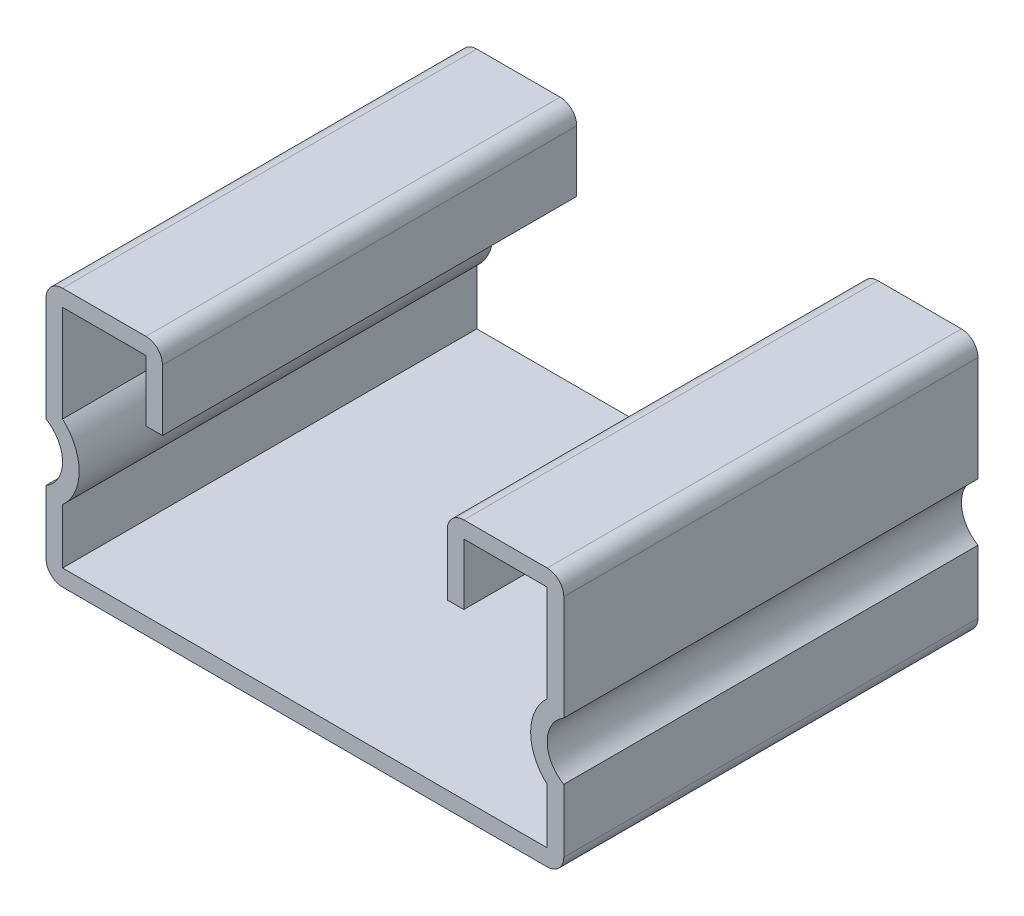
ISO-10303-21;
HEADER;
FILE_DESCRIPTION(('STEP AP214'),'2;1');
FILE_NAME('part.step','',(''),(''),'','','');
FILE_SCHEMA(('AUTOMOTIVE_DESIGN { 1 0 10303 214 1 1 1 1 }'));
ENDSEC;
DATA;
#1=APPLICATION_CONTEXT('core data for automotive mechanical design processes');
#2=APPLICATION_PROTOCOL_DEFINITION('international standard','automotive_design',2000,#1);
#3=PRODUCT_CONTEXT('',#1,'mechanical');
#4=PRODUCT('Part','Part','',(#3));
#5=PRODUCT_RELATED_PRODUCT_CATEGORY('part','',(#4));
#6=PRODUCT_DEFINITION_FORMATION('','',#4);
#7=PRODUCT_DEFINITION_CONTEXT('part definition',#1,'design');
#8=PRODUCT_DEFINITION('design','',#6,#7);
#9=PRODUCT_DEFINITION_SHAPE('','',#8);
#10=(LENGTH_UNIT() NAMED_UNIT(*) SI_UNIT(.MILLI.,.METRE.));
#11=(NAMED_UNIT(*) PLANE_ANGLE_UNIT() SI_UNIT($,.RADIAN.));
#12=(NAMED_UNIT(*) SI_UNIT($,.STERADIAN.) SOLID_ANGLE_UNIT());
#13=UNCERTAINTY_MEASURE_WITH_UNIT(LENGTH_MEASURE(1.E-05),#10,'distance_accuracy_value','');
#14=(GEOMETRIC_REPRESENTATION_CONTEXT(3) GLOBAL_UNCERTAINTY_ASSIGNED_CONTEXT((#13)) GLOBAL_UNIT_ASSIGNED_CONTEXT((#10,
#11,#12)) REPRESENTATION_CONTEXT('',''));
#15=CARTESIAN_POINT('',(0.,0.,0.));
#16=DIRECTION('',(0.,0.,1.));
#17=DIRECTION('',(1.,0.,0.));
#18=AXIS2_PLACEMENT_3D('',#15,#16,#17);
#19=CARTESIAN_POINT('',(-14.859,8.2042,12.7));
#20=DIRECTION('',(-1.,0.,0.));
#21=DIRECTION('',(0.,-1.,0.));
#22=AXIS2_PLACEMENT_3D('',#19,#20,#21);
#23=PLANE('',#22);
#24=DIRECTION('',(0.,1.,0.));
#25=VECTOR('',#24,1.);
#26=CARTESIAN_POINT('',(-14.859,8.2042,-12.7));
#27=LINE('',#26,#25);
#28=CARTESIAN_POINT('',(-14.859,2.27184506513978,-12.7));
#29=VERTEX_POINT('',#28);
#30=CARTESIAN_POINT('',(-14.859,8.2042,-12.7));
#31=VERTEX_POINT('',#30);
#32=EDGE_CURVE('E260',#29,#31,#27,.T.);
#33=ORIENTED_EDGE('',*,*,#32,.T.);
#34=DIRECTION('',(0.,0.,-1.));
#35=VECTOR('',#34,1.);
#36=CARTESIAN_POINT('',(-14.859,8.2042,12.7));
#37=LINE('',#36,#35);
#38=CARTESIAN_POINT('',(-14.859,8.2042,12.7));
#39=VERTEX_POINT('',#38);
#40=EDGE_CURVE('E11',#39,#31,#37,.T.);
#41=ORIENTED_EDGE('',*,*,#40,.F.);
#42=DIRECTION('',(0.,1.,0.));
#43=VECTOR('',#42,1.);
#44=CARTESIAN_POINT('',(-14.859,8.2042,12.7));
#45=LINE('',#44,#43);
#46=CARTESIAN_POINT('',(-14.859,2.27184506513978,12.7));
#47=VERTEX_POINT('',#46);
#48=EDGE_CURVE('E318',#47,#39,#45,.T.);
#49=ORIENTED_EDGE('',*,*,#48,.F.);
#50=DIRECTION('',(0.,0.,-1.));
#51=VECTOR('',#50,1.);
#52=CARTESIAN_POINT('',(-14.859,2.27184506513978,12.7));
#53=LINE('',#52,#51);
#54=EDGE_CURVE('E256',#47,#29,#53,.T.);
#55=ORIENTED_EDGE('',*,*,#54,.T.);
#56=EDGE_LOOP('',(#33,#41,#49,#55));
#57=FACE_BOUND('',#56,.T.);
#58=ADVANCED_FACE('F32',(#57),#23,.F.);
#59=CARTESIAN_POINT('',(-14.859,8.2042,12.7));
#60=DIRECTION('',(0.,1.,0.));
#61=DIRECTION('',(-1.,0.,0.));
#62=AXIS2_PLACEMENT_3D('',#59,#60,#61);
#63=PLANE('',#62);
#64=DIRECTION('',(1.,0.,0.));
#65=VECTOR('',#64,1.);
#66=CARTESIAN_POINT('',(-14.859,8.2042,-12.7));
#67=LINE('',#66,#65);
#68=CARTESIAN_POINT('',(-9.74725,8.20419999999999,-12.7));
#69=VERTEX_POINT('',#68);
#70=EDGE_CURVE('E263',#31,#69,#67,.T.);
#71=ORIENTED_EDGE('',*,*,#70,.T.);
#72=DIRECTION('',(0.,0.,-1.));
#73=VECTOR('',#72,1.);
#74=CARTESIAN_POINT('',(-9.74725,8.20419999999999,12.7));
#75=LINE('',#74,#73);
#76=CARTESIAN_POINT('',(-9.74725,8.20419999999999,12.7));
#77=VERTEX_POINT('',#76);
#78=EDGE_CURVE('E40',#77,#69,#75,.T.);
#79=ORIENTED_EDGE('',*,*,#78,.F.);
#80=DIRECTION('',(1.,0.,0.));
#81=VECTOR('',#80,1.);
#82=CARTESIAN_POINT('',(-14.859,8.2042,12.7));
#83=LINE('',#82,#81);
#84=EDGE_CURVE('E157',#39,#77,#83,.T.);
#85=ORIENTED_EDGE('',*,*,#84,.F.);
#86=ORIENTED_EDGE('',*,*,#40,.T.);
#87=EDGE_LOOP('',(#71,#79,#85,#86));
#88=FACE_BOUND('',#87,.T.);
#89=ADVANCED_FACE('F486',(#88),#63,.F.);
#90=CARTESIAN_POINT('',(-9.74725,8.20419999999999,12.7));
#91=DIRECTION('',(1.,0.,0.));
#92=DIRECTION('',(0.,0.,-1.));
#93=AXIS2_PLACEMENT_3D('',#90,#91,#92);
#94=PLANE('',#93);
#95=DIRECTION('',(0.,-1.,0.));
#96=VECTOR('',#95,1.);
#97=CARTESIAN_POINT('',(-9.74725,8.20419999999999,-12.7));
#98=LINE('',#97,#96);
#99=CARTESIAN_POINT('',(-9.74725,4.4577,-12.7));
#100=VERTEX_POINT('',#99);
#101=EDGE_CURVE('E265',#69,#100,#98,.T.);
#102=ORIENTED_EDGE('',*,*,#101,.T.);
#103=DIRECTION('',(0.,0.,-1.));
#104=VECTOR('',#103,1.);
#105=CARTESIAN_POINT('',(-9.74725,4.4577,12.7));
#106=LINE('',#105,#104);
#107=CARTESIAN_POINT('',(-9.74725,4.4577,12.7));
#108=VERTEX_POINT('',#107);
#109=EDGE_CURVE('E391',#108,#100,#106,.T.);
#110=ORIENTED_EDGE('',*,*,#109,.F.);
#111=DIRECTION('',(0.,-1.,0.));
#112=VECTOR('',#111,1.);
#113=CARTESIAN_POINT('',(-9.74725,8.20419999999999,12.7));
#114=LINE('',#113,#112);
#115=EDGE_CURVE('E399',#77,#108,#114,.T.);
#116=ORIENTED_EDGE('',*,*,#115,.F.);
#117=ORIENTED_EDGE('',*,*,#78,.T.);
#118=EDGE_LOOP('',(#102,#110,#116,#117));
#119=FACE_BOUND('',#118,.T.);
#120=ADVANCED_FACE('F397',(#119),#94,.F.);
#121=CARTESIAN_POINT('',(-9.74725,4.4577,12.7));
#122=DIRECTION('',(0.,1.,0.));
#123=DIRECTION('',(0.,0.,1.));
#124=AXIS2_PLACEMENT_3D('',#121,#122,#123);
#125=PLANE('',#124);
#126=DIRECTION('',(1.,0.,0.));
#127=VECTOR('',#126,1.);
#128=CARTESIAN_POINT('',(-9.74725,4.4577,-12.7));
#129=LINE('',#128,#127);
#130=CARTESIAN_POINT('',(-8.73125,4.4577,-12.7));
#131=VERTEX_POINT('',#130);
#132=EDGE_CURVE('E267',#100,#131,#129,.T.);
#133=ORIENTED_EDGE('',*,*,#132,.T.);
#134=DIRECTION('',(0.,0.,-1.));
#135=VECTOR('',#134,1.);
#136=CARTESIAN_POINT('',(-8.73125,4.4577,12.7));
#137=LINE('',#136,#135);
#138=CARTESIAN_POINT('',(-8.73125,4.4577,12.7));
#139=VERTEX_POINT('',#138);
#140=EDGE_CURVE('E388',#139,#131,#137,.T.);
#141=ORIENTED_EDGE('',*,*,#140,.F.);
#142=DIRECTION('',(1.,0.,0.));
#143=VECTOR('',#142,1.);
#144=CARTESIAN_POINT('',(-9.74725,4.4577,12.7));
#145=LINE('',#144,#143);
#146=EDGE_CURVE('E417',#108,#139,#145,.T.);
#147=ORIENTED_EDGE('',*,*,#146,.F.);
#148=ORIENTED_EDGE('',*,*,#109,.T.);
#149=EDGE_LOOP('',(#133,#141,#147,#148));
#150=FACE_BOUND('',#149,.T.);
#151=ADVANCED_FACE('F408',(#150),#125,.F.);
#152=CARTESIAN_POINT('',(-8.73125,8.20419999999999,12.7));
#153=DIRECTION('',(-1.,0.,0.));
#154=DIRECTION('',(0.,-1.,0.));
#155=AXIS2_PLACEMENT_3D('',#152,#153,#154);
#156=PLANE('',#155);
#157=DIRECTION('',(0.,1.,0.));
#158=VECTOR('',#157,1.);
#159=CARTESIAN_POINT('',(-8.73125,8.20419999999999,-12.7));
#160=LINE('',#159,#158);
#161=CARTESIAN_POINT('',(-8.73125,8.20419999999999,-12.7));
#162=VERTEX_POINT('',#161);
#163=EDGE_CURVE('E269',#131,#162,#160,.T.);
#164=ORIENTED_EDGE('',*,*,#163,.T.);
#165=DIRECTION('',(0.,0.,-1.));
#166=VECTOR('',#165,1.);
#167=CARTESIAN_POINT('',(-8.73125,8.20419999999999,12.7));
#168=LINE('',#167,#166);
#169=CARTESIAN_POINT('',(-8.73125,8.20419999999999,12.7));
#170=VERTEX_POINT('',#169);
#171=EDGE_CURVE('E385',#170,#162,#168,.T.);
#172=ORIENTED_EDGE('',*,*,#171,.F.);
#173=DIRECTION('',(0.,1.,0.));
#174=VECTOR('',#173,1.);
#175=CARTESIAN_POINT('',(-8.73125,8.20419999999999,12.7));
#176=LINE('',#175,#174);
#177=EDGE_CURVE('E414',#139,#170,#176,.T.);
#178=ORIENTED_EDGE('',*,*,#177,.F.);
#179=ORIENTED_EDGE('',*,*,#140,.T.);
#180=EDGE_LOOP('',(#164,#172,#178,#179));
#181=FACE_BOUND('',#180,.T.);
#182=ADVANCED_FACE('F412',(#181),#156,.F.);
#183=CARTESIAN_POINT('',(-9.74725,8.20419999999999,12.7));
#184=DIRECTION('',(0.,0.,-1.));
#185=DIRECTION('',(-1.,0.,0.));
#186=AXIS2_PLACEMENT_3D('',#183,#184,#185);
#187=CYLINDRICAL_SURFACE('',#186,1.016);
#188=CARTESIAN_POINT('',(-9.74725,8.20419999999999,-12.7));
#189=DIRECTION('',(0.,0.,1.));
#190=DIRECTION('',(-1.,0.,0.));
#191=AXIS2_PLACEMENT_3D('',#188,#189,#190);
#192=CIRCLE('',#191,1.016);
#193=CARTESIAN_POINT('',(-9.74725,9.22019999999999,-12.7));
#194=VERTEX_POINT('',#193);
#195=EDGE_CURVE('E271',#162,#194,#192,.T.);
#196=ORIENTED_EDGE('',*,*,#195,.T.);
#197=DIRECTION('',(0.,0.,-1.));
#198=VECTOR('',#197,1.);
#199=CARTESIAN_POINT('',(-9.74725,9.22019999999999,12.7));
#200=LINE('',#199,#198);
#201=CARTESIAN_POINT('',(-9.74725,9.22019999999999,12.7));
#202=VERTEX_POINT('',#201);
#203=EDGE_CURVE('E382',#202,#194,#200,.T.);
#204=ORIENTED_EDGE('',*,*,#203,.F.);
#205=CARTESIAN_POINT('',(-9.74725,8.20419999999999,12.7));
#206=DIRECTION('',(0.,0.,1.));
#207=DIRECTION('',(-1.,0.,0.));
#208=AXIS2_PLACEMENT_3D('',#205,#206,#207);
#209=CIRCLE('',#208,1.016);
#210=EDGE_CURVE('E416',#170,#202,#209,.T.);
#211=ORIENTED_EDGE('',*,*,#210,.F.);
#212=ORIENTED_EDGE('',*,*,#171,.T.);
#213=EDGE_LOOP('',(#196,#204,#211,#212));
#214=FACE_BOUND('',#213,.T.);
#215=ADVANCED_FACE('F499',(#214),#187,.T.);
#216=CARTESIAN_POINT('',(-14.859,9.2202,12.7));
#217=DIRECTION('',(0.,-1.,0.));
#218=DIRECTION('',(1.,0.,0.));
#219=AXIS2_PLACEMENT_3D('',#216,#217,#218);
#220=PLANE('',#219);
#221=DIRECTION('',(-1.,0.,0.));
#222=VECTOR('',#221,1.);
#223=CARTESIAN_POINT('',(-14.859,9.2202,-12.7));
#224=LINE('',#223,#222);
#225=CARTESIAN_POINT('',(-14.859,9.2202,-12.7));
#226=VERTEX_POINT('',#225);
#227=EDGE_CURVE('E273',#194,#226,#224,.T.);
#228=ORIENTED_EDGE('',*,*,#227,.T.);
#229=DIRECTION('',(0.,0.,-1.));
#230=VECTOR('',#229,1.);
#231=CARTESIAN_POINT('',(-14.859,9.2202,12.7));
#232=LINE('',#231,#230);
#233=CARTESIAN_POINT('',(-14.859,9.2202,12.7));
#234=VERTEX_POINT('',#233);
#235=EDGE_CURVE('E379',#234,#226,#232,.T.);
#236=ORIENTED_EDGE('',*,*,#235,.F.);
#237=DIRECTION('',(-1.,0.,0.));
#238=VECTOR('',#237,1.);
#239=CARTESIAN_POINT('',(-14.859,9.2202,12.7));
#240=LINE('',#239,#238);
#241=EDGE_CURVE('E419',#202,#234,#240,.T.);
#242=ORIENTED_EDGE('',*,*,#241,.F.);
#243=ORIENTED_EDGE('',*,*,#203,.T.);
#244=EDGE_LOOP('',(#228,#236,#242,#243));
#245=FACE_BOUND('',#244,.T.);
#246=ADVANCED_FACE('F502',(#245),#220,.F.);
#247=CARTESIAN_POINT('',(-14.859,8.2042,12.7));
#248=DIRECTION('',(0.,0.,-1.));
#249=DIRECTION('',(-1.,0.,0.));
#250=AXIS2_PLACEMENT_3D('',#247,#248,#249);
#251=CYLINDRICAL_SURFACE('',#250,1.016);
#252=CARTESIAN_POINT('',(-14.859,8.2042,-12.7));
#253=DIRECTION('',(0.,0.,1.));
#254=DIRECTION('',(-1.,0.,0.));
#255=AXIS2_PLACEMENT_3D('',#252,#253,#254);
#256=CIRCLE('',#255,1.016);
#257=CARTESIAN_POINT('',(-15.875,8.2042,-12.7));
#258=VERTEX_POINT('',#257);
#259=EDGE_CURVE('E275',#226,#258,#256,.T.);
#260=ORIENTED_EDGE('',*,*,#259,.T.);
#261=DIRECTION('',(0.,0.,-1.));
#262=VECTOR('',#261,1.);
#263=CARTESIAN_POINT('',(-15.875,8.2042,12.7));
#264=LINE('',#263,#262);
#265=CARTESIAN_POINT('',(-15.875,8.2042,12.7));
#266=VERTEX_POINT('',#265);
#267=EDGE_CURVE('E376',#266,#258,#264,.T.);
#268=ORIENTED_EDGE('',*,*,#267,.F.);
#269=CARTESIAN_POINT('',(-14.859,8.2042,12.7));
#270=DIRECTION('',(0.,0.,1.));
#271=DIRECTION('',(-1.,0.,0.));
#272=AXIS2_PLACEMENT_3D('',#269,#270,#271);
#273=CIRCLE('',#272,1.016);
#274=EDGE_CURVE('E425',#234,#266,#273,.T.);
#275=ORIENTED_EDGE('',*,*,#274,.F.);
#276=ORIENTED_EDGE('',*,*,#235,.T.);
#277=EDGE_LOOP('',(#260,#268,#275,#276));
#278=FACE_BOUND('',#277,.T.);
#279=ADVANCED_FACE('F506',(#278),#251,.T.);
#280=CARTESIAN_POINT('',(-15.875,8.2042,12.7));
#281=DIRECTION('',(1.,0.,0.));
#282=DIRECTION('',(0.,0.,-1.));
#283=AXIS2_PLACEMENT_3D('',#280,#281,#282);
#284=PLANE('',#283);
#285=DIRECTION('',(0.,-1.,0.));
#286=VECTOR('',#285,1.);
#287=CARTESIAN_POINT('',(-15.875,8.2042,-12.7));
#288=LINE('',#287,#286);
#289=CARTESIAN_POINT('',(-15.875,1.75976362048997,-12.7));
#290=VERTEX_POINT('',#289);
#291=EDGE_CURVE('E277',#258,#290,#288,.T.);
#292=ORIENTED_EDGE('',*,*,#291,.T.);
#293=DIRECTION('',(0.,0.,-1.));
#294=VECTOR('',#293,1.);
#295=CARTESIAN_POINT('',(-15.875,1.75976362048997,12.7));
#296=LINE('',#295,#294);
#297=CARTESIAN_POINT('',(-15.875,1.75976362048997,12.7));
#298=VERTEX_POINT('',#297);
#299=EDGE_CURVE('E373',#298,#290,#296,.T.);
#300=ORIENTED_EDGE('',*,*,#299,.F.);
#301=DIRECTION('',(0.,-1.,0.));
#302=VECTOR('',#301,1.);
#303=CARTESIAN_POINT('',(-15.875,8.2042,12.7));
#304=LINE('',#303,#302);
#305=EDGE_CURVE('E427',#266,#298,#304,.T.);
#306=ORIENTED_EDGE('',*,*,#305,.F.);
#307=ORIENTED_EDGE('',*,*,#267,.T.);
#308=EDGE_LOOP('',(#292,#300,#306,#307));
#309=FACE_BOUND('',#308,.T.);
#310=ADVANCED_FACE('F510',(#309),#284,.F.);
#311=CARTESIAN_POINT('',(-16.891,0.,12.7));
#312=DIRECTION('',(0.,0.,-1.));
#313=DIRECTION('',(-1.,0.,0.));
#314=AXIS2_PLACEMENT_3D('',#311,#312,#313);
#315=CYLINDRICAL_SURFACE('',#314,2.032);
#316=CARTESIAN_POINT('',(-16.891,0.,-12.7));
#317=DIRECTION('',(0.,0.,-1.));
#318=DIRECTION('',(1.,0.,0.));
#319=AXIS2_PLACEMENT_3D('',#316,#317,#318);
#320=CIRCLE('',#319,2.032);
#321=CARTESIAN_POINT('',(-15.875,-1.75976362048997,-12.7));
#322=VERTEX_POINT('',#321);
#323=EDGE_CURVE('E279',#290,#322,#320,.T.);
#324=ORIENTED_EDGE('',*,*,#323,.T.);
#325=DIRECTION('',(0.,0.,-1.));
#326=VECTOR('',#325,1.);
#327=CARTESIAN_POINT('',(-15.875,-1.75976362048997,12.7));
#328=LINE('',#327,#326);
#329=CARTESIAN_POINT('',(-15.875,-1.75976362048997,12.7));
#330=VERTEX_POINT('',#329);
#331=EDGE_CURVE('E370',#330,#322,#328,.T.);
#332=ORIENTED_EDGE('',*,*,#331,.F.);
#333=CARTESIAN_POINT('',(-16.891,0.,12.7));
#334=DIRECTION('',(0.,0.,-1.));
#335=DIRECTION('',(1.,0.,0.));
#336=AXIS2_PLACEMENT_3D('',#333,#334,#335);
#337=CIRCLE('',#336,2.032);
#338=EDGE_CURVE('E429',#298,#330,#337,.T.);
#339=ORIENTED_EDGE('',*,*,#338,.F.);
#340=ORIENTED_EDGE('',*,*,#299,.T.);
#341=EDGE_LOOP('',(#324,#332,#339,#340));
#342=FACE_BOUND('',#341,.T.);
#343=ADVANCED_FACE('F514',(#342),#315,.F.);
#344=CARTESIAN_POINT('',(-15.875,-1.75976362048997,12.7));
#345=DIRECTION('',(1.,0.,0.));
#346=DIRECTION('',(0.,1.,0.));
#347=AXIS2_PLACEMENT_3D('',#344,#345,#346);
#348=PLANE('',#347);
#349=DIRECTION('',(0.,-1.,0.));
#350=VECTOR('',#349,1.);
#351=CARTESIAN_POINT('',(-15.875,-1.75976362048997,-12.7));
#352=LINE('',#351,#350);
#353=CARTESIAN_POINT('',(-15.875,-5.6388,-12.7));
#354=VERTEX_POINT('',#353);
#355=EDGE_CURVE('E281',#322,#354,#352,.T.);
#356=ORIENTED_EDGE('',*,*,#355,.T.);
#357=DIRECTION('',(0.,0.,-1.));
#358=VECTOR('',#357,1.);
#359=CARTESIAN_POINT('',(-15.875,-5.6388,12.7));
#360=LINE('',#359,#358);
#361=CARTESIAN_POINT('',(-15.875,-5.6388,12.7));
#362=VERTEX_POINT('',#361);
#363=EDGE_CURVE('E367',#362,#354,#360,.T.);
#364=ORIENTED_EDGE('',*,*,#363,.F.);
#365=DIRECTION('',(0.,-1.,0.));
#366=VECTOR('',#365,1.);
#367=CARTESIAN_POINT('',(-15.875,-1.75976362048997,12.7));
#368=LINE('',#367,#366);
#369=EDGE_CURVE('E431',#330,#362,#368,.T.);
#370=ORIENTED_EDGE('',*,*,#369,.F.);
#371=ORIENTED_EDGE('',*,*,#331,.T.);
#372=EDGE_LOOP('',(#356,#364,#370,#371));
#373=FACE_BOUND('',#372,.T.);
#374=ADVANCED_FACE('F518',(#373),#348,.F.);
#375=CARTESIAN_POINT('',(-14.859,-5.6388,12.7));
#376=DIRECTION('',(0.,0.,-1.));
#377=DIRECTION('',(-1.,0.,0.));
#378=AXIS2_PLACEMENT_3D('',#375,#376,#377);
#379=CYLINDRICAL_SURFACE('',#378,1.016);
#380=CARTESIAN_POINT('',(-14.859,-5.6388,-12.7));
#381=DIRECTION('',(0.,0.,1.));
#382=DIRECTION('',(-1.,0.,0.));
#383=AXIS2_PLACEMENT_3D('',#380,#381,#382);
#384=CIRCLE('',#383,1.016);
#385=CARTESIAN_POINT('',(-14.859,-6.6548,-12.7));
#386=VERTEX_POINT('',#385);
#387=EDGE_CURVE('E283',#354,#386,#384,.T.);
#388=ORIENTED_EDGE('',*,*,#387,.T.);
#389=DIRECTION('',(0.,0.,-1.));
#390=VECTOR('',#389,1.);
#391=CARTESIAN_POINT('',(-14.859,-6.6548,12.7));
#392=LINE('',#391,#390);
#393=CARTESIAN_POINT('',(-14.859,-6.6548,12.7));
#394=VERTEX_POINT('',#393);
#395=EDGE_CURVE('E364',#394,#386,#392,.T.);
#396=ORIENTED_EDGE('',*,*,#395,.F.);
#397=CARTESIAN_POINT('',(-14.859,-5.6388,12.7));
#398=DIRECTION('',(0.,0.,1.));
#399=DIRECTION('',(-1.,0.,0.));
#400=AXIS2_PLACEMENT_3D('',#397,#398,#399);
#401=CIRCLE('',#400,1.016);
#402=EDGE_CURVE('E433',#362,#394,#401,.T.);
#403=ORIENTED_EDGE('',*,*,#402,.F.);
#404=ORIENTED_EDGE('',*,*,#363,.T.);
#405=EDGE_LOOP('',(#388,#396,#403,#404));
#406=FACE_BOUND('',#405,.T.);
#407=ADVANCED_FACE('F522',(#406),#379,.T.);
#408=CARTESIAN_POINT('',(-14.859,-6.6548,12.7));
#409=DIRECTION('',(0.,1.,0.));
#410=DIRECTION('',(0.,0.,1.));
#411=AXIS2_PLACEMENT_3D('',#408,#409,#410);
#412=PLANE('',#411);
#413=DIRECTION('',(1.,0.,0.));
#414=VECTOR('',#413,1.);
#415=CARTESIAN_POINT('',(-14.859,-6.6548,-12.7));
#416=LINE('',#415,#414);
#417=CARTESIAN_POINT('',(14.859,-6.6548,-12.7));
#418=VERTEX_POINT('',#417);
#419=EDGE_CURVE('E285',#386,#418,#416,.T.);
#420=ORIENTED_EDGE('',*,*,#419,.T.);
#421=DIRECTION('',(0.,0.,-1.));
#422=VECTOR('',#421,1.);
#423=CARTESIAN_POINT('',(14.859,-6.6548,12.7));
#424=LINE('',#423,#422);
#425=CARTESIAN_POINT('',(14.859,-6.6548,12.7));
#426=VERTEX_POINT('',#425);
#427=EDGE_CURVE('E361',#426,#418,#424,.T.);
#428=ORIENTED_EDGE('',*,*,#427,.F.);
#429=DIRECTION('',(1.,0.,0.));
#430=VECTOR('',#429,1.);
#431=CARTESIAN_POINT('',(-14.859,-6.6548,12.7));
#432=LINE('',#431,#430);
#433=EDGE_CURVE('E435',#394,#426,#432,.T.);
#434=ORIENTED_EDGE('',*,*,#433,.F.);
#435=ORIENTED_EDGE('',*,*,#395,.T.);
#436=EDGE_LOOP('',(#420,#428,#434,#435));
#437=FACE_BOUND('',#436,.T.);
#438=ADVANCED_FACE('F526',(#437),#412,.F.);
#439=CARTESIAN_POINT('',(14.859,-5.6388,12.7));
#440=DIRECTION('',(0.,0.,-1.));
#441=DIRECTION('',(-1.,0.,0.));
#442=AXIS2_PLACEMENT_3D('',#439,#440,#441);
#443=CYLINDRICAL_SURFACE('',#442,1.016);
#444=CARTESIAN_POINT('',(14.859,-5.6388,-12.7));
#445=DIRECTION('',(0.,0.,1.));
#446=DIRECTION('',(-1.,0.,0.));
#447=AXIS2_PLACEMENT_3D('',#444,#445,#446);
#448=CIRCLE('',#447,1.016);
#449=CARTESIAN_POINT('',(15.875,-5.6388,-12.7));
#450=VERTEX_POINT('',#449);
#451=EDGE_CURVE('E287',#418,#450,#448,.T.);
#452=ORIENTED_EDGE('',*,*,#451,.T.);
#453=DIRECTION('',(0.,0.,-1.));
#454=VECTOR('',#453,1.);
#455=CARTESIAN_POINT('',(15.875,-5.6388,12.7));
#456=LINE('',#455,#454);
#457=CARTESIAN_POINT('',(15.875,-5.6388,12.7));
#458=VERTEX_POINT('',#457);
#459=EDGE_CURVE('E358',#458,#450,#456,.T.);
#460=ORIENTED_EDGE('',*,*,#459,.F.);
#461=CARTESIAN_POINT('',(14.859,-5.6388,12.7));
#462=DIRECTION('',(0.,0.,1.));
#463=DIRECTION('',(-1.,0.,0.));
#464=AXIS2_PLACEMENT_3D('',#461,#462,#463);
#465=CIRCLE('',#464,1.016);
#466=EDGE_CURVE('E437',#426,#458,#465,.T.);
#467=ORIENTED_EDGE('',*,*,#466,.F.);
#468=ORIENTED_EDGE('',*,*,#427,.T.);
#469=EDGE_LOOP('',(#452,#460,#467,#468));
#470=FACE_BOUND('',#469,.T.);
#471=ADVANCED_FACE('F530',(#470),#443,.T.);
#472=CARTESIAN_POINT('',(15.875,-5.6388,12.7));
#473=DIRECTION('',(-1.,0.,0.));
#474=DIRECTION('',(0.,0.,1.));
#475=AXIS2_PLACEMENT_3D('',#472,#473,#474);
#476=PLANE('',#475);
#477=DIRECTION('',(0.,1.,0.));
#478=VECTOR('',#477,1.);
#479=CARTESIAN_POINT('',(15.875,-5.6388,-12.7));
#480=LINE('',#479,#478);
#481=CARTESIAN_POINT('',(15.875,-1.75976362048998,-12.7));
#482=VERTEX_POINT('',#481);
#483=EDGE_CURVE('E289',#450,#482,#480,.T.);
#484=ORIENTED_EDGE('',*,*,#483,.T.);
#485=DIRECTION('',(0.,0.,-1.));
#486=VECTOR('',#485,1.);
#487=CARTESIAN_POINT('',(15.875,-1.75976362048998,12.7));
#488=LINE('',#487,#486);
#489=CARTESIAN_POINT('',(15.875,-1.75976362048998,12.7));
#490=VERTEX_POINT('',#489);
#491=EDGE_CURVE('E355',#490,#482,#488,.T.);
#492=ORIENTED_EDGE('',*,*,#491,.F.);
#493=DIRECTION('',(0.,1.,0.));
#494=VECTOR('',#493,1.);
#495=CARTESIAN_POINT('',(15.875,-5.6388,12.7));
#496=LINE('',#495,#494);
#497=EDGE_CURVE('E439',#458,#490,#496,.T.);
#498=ORIENTED_EDGE('',*,*,#497,.F.);
#499=ORIENTED_EDGE('',*,*,#459,.T.);
#500=EDGE_LOOP('',(#484,#492,#498,#499));
#501=FACE_BOUND('',#500,.T.);
#502=ADVANCED_FACE('F534',(#501),#476,.F.);
#503=CARTESIAN_POINT('',(16.891,0.,12.7));
#504=DIRECTION('',(0.,0.,-1.));
#505=DIRECTION('',(-1.,0.,0.));
#506=AXIS2_PLACEMENT_3D('',#503,#504,#505);
#507=CYLINDRICAL_SURFACE('',#506,2.032);
#508=CARTESIAN_POINT('',(16.891,0.,-12.7));
#509=DIRECTION('',(0.,0.,-1.));
#510=DIRECTION('',(1.,0.,0.));
#511=AXIS2_PLACEMENT_3D('',#508,#509,#510);
#512=CIRCLE('',#511,2.032);
#513=CARTESIAN_POINT('',(15.875,1.75976362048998,-12.7));
#514=VERTEX_POINT('',#513);
#515=EDGE_CURVE('E291',#482,#514,#512,.T.);
#516=ORIENTED_EDGE('',*,*,#515,.T.);
#517=DIRECTION('',(0.,0.,-1.));
#518=VECTOR('',#517,1.);
#519=CARTESIAN_POINT('',(15.875,1.75976362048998,12.7));
#520=LINE('',#519,#518);
#521=CARTESIAN_POINT('',(15.875,1.75976362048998,12.7));
#522=VERTEX_POINT('',#521);
#523=EDGE_CURVE('E352',#522,#514,#520,.T.);
#524=ORIENTED_EDGE('',*,*,#523,.F.);
#525=CARTESIAN_POINT('',(16.891,0.,12.7));
#526=DIRECTION('',(0.,0.,-1.));
#527=DIRECTION('',(1.,0.,0.));
#528=AXIS2_PLACEMENT_3D('',#525,#526,#527);
#529=CIRCLE('',#528,2.032);
#530=EDGE_CURVE('E441',#490,#522,#529,.T.);
#531=ORIENTED_EDGE('',*,*,#530,.F.);
#532=ORIENTED_EDGE('',*,*,#491,.T.);
#533=EDGE_LOOP('',(#516,#524,#531,#532));
#534=FACE_BOUND('',#533,.T.);
#535=ADVANCED_FACE('F538',(#534),#507,.F.);
#536=CARTESIAN_POINT('',(15.875,1.75976362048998,12.7));
#537=DIRECTION('',(-1.,0.,0.));
#538=DIRECTION('',(0.,-1.,0.));
#539=AXIS2_PLACEMENT_3D('',#536,#537,#538);
#540=PLANE('',#539);
#541=DIRECTION('',(0.,1.,0.));
#542=VECTOR('',#541,1.);
#543=CARTESIAN_POINT('',(15.875,1.75976362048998,-12.7));
#544=LINE('',#543,#542);
#545=CARTESIAN_POINT('',(15.875,8.2042,-12.7));
#546=VERTEX_POINT('',#545);
#547=EDGE_CURVE('E293',#514,#546,#544,.T.);
#548=ORIENTED_EDGE('',*,*,#547,.T.);
#549=DIRECTION('',(0.,0.,-1.));
#550=VECTOR('',#549,1.);
#551=CARTESIAN_POINT('',(15.875,8.2042,12.7));
#552=LINE('',#551,#550);
#553=CARTESIAN_POINT('',(15.875,8.2042,12.7));
#554=VERTEX_POINT('',#553);
#555=EDGE_CURVE('E349',#554,#546,#552,.T.);
#556=ORIENTED_EDGE('',*,*,#555,.F.);
#557=DIRECTION('',(0.,1.,0.));
#558=VECTOR('',#557,1.);
#559=CARTESIAN_POINT('',(15.875,1.75976362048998,12.7));
#560=LINE('',#559,#558);
#561=EDGE_CURVE('E443',#522,#554,#560,.T.);
#562=ORIENTED_EDGE('',*,*,#561,.F.);
#563=ORIENTED_EDGE('',*,*,#523,.T.);
#564=EDGE_LOOP('',(#548,#556,#562,#563));
#565=FACE_BOUND('',#564,.T.);
#566=ADVANCED_FACE('F542',(#565),#540,.F.);
#567=CARTESIAN_POINT('',(14.859,8.2042,12.7));
#568=DIRECTION('',(0.,0.,-1.));
#569=DIRECTION('',(-1.,0.,0.));
#570=AXIS2_PLACEMENT_3D('',#567,#568,#569);
#571=CYLINDRICAL_SURFACE('',#570,1.016);
#572=CARTESIAN_POINT('',(14.859,8.2042,-12.7));
#573=DIRECTION('',(0.,0.,1.));
#574=DIRECTION('',(-1.,0.,0.));
#575=AXIS2_PLACEMENT_3D('',#572,#573,#574);
#576=CIRCLE('',#575,1.016);
#577=CARTESIAN_POINT('',(14.859,9.2202,-12.7));
#578=VERTEX_POINT('',#577);
#579=EDGE_CURVE('E295',#546,#578,#576,.T.);
#580=ORIENTED_EDGE('',*,*,#579,.T.);
#581=DIRECTION('',(0.,0.,-1.));
#582=VECTOR('',#581,1.);
#583=CARTESIAN_POINT('',(14.859,9.2202,12.7));
#584=LINE('',#583,#582);
#585=CARTESIAN_POINT('',(14.859,9.2202,12.7));
#586=VERTEX_POINT('',#585);
#587=EDGE_CURVE('E346',#586,#578,#584,.T.);
#588=ORIENTED_EDGE('',*,*,#587,.F.);
#589=CARTESIAN_POINT('',(14.859,8.2042,12.7));
#590=DIRECTION('',(0.,0.,1.));
#591=DIRECTION('',(-1.,0.,0.));
#592=AXIS2_PLACEMENT_3D('',#589,#590,#591);
#593=CIRCLE('',#592,1.016);
#594=EDGE_CURVE('E445',#554,#586,#593,.T.);
#595=ORIENTED_EDGE('',*,*,#594,.F.);
#596=ORIENTED_EDGE('',*,*,#555,.T.);
#597=EDGE_LOOP('',(#580,#588,#595,#596));
#598=FACE_BOUND('',#597,.T.);
#599=ADVANCED_FACE('F546',(#598),#571,.T.);
#600=CARTESIAN_POINT('',(14.859,9.2202,12.7));
#601=DIRECTION('',(0.,-1.,0.));
#602=DIRECTION('',(1.,0.,0.));
#603=AXIS2_PLACEMENT_3D('',#600,#601,#602);
#604=PLANE('',#603);
#605=DIRECTION('',(-1.,0.,0.));
#606=VECTOR('',#605,1.);
#607=CARTESIAN_POINT('',(14.859,9.2202,-12.7));
#608=LINE('',#607,#606);
#609=CARTESIAN_POINT('',(9.74725,9.2202,-12.7));
#610=VERTEX_POINT('',#609);
#611=EDGE_CURVE('E297',#578,#610,#608,.T.);
#612=ORIENTED_EDGE('',*,*,#611,.T.);
#613=DIRECTION('',(0.,0.,-1.));
#614=VECTOR('',#613,1.);
#615=CARTESIAN_POINT('',(9.74725,9.2202,12.7));
#616=LINE('',#615,#614);
#617=CARTESIAN_POINT('',(9.74725,9.2202,12.7));
#618=VERTEX_POINT('',#617);
#619=EDGE_CURVE('E343',#618,#610,#616,.T.);
#620=ORIENTED_EDGE('',*,*,#619,.F.);
#621=DIRECTION('',(-1.,0.,0.));
#622=VECTOR('',#621,1.);
#623=CARTESIAN_POINT('',(14.859,9.2202,12.7));
#624=LINE('',#623,#622);
#625=EDGE_CURVE('E447',#586,#618,#624,.T.);
#626=ORIENTED_EDGE('',*,*,#625,.F.);
#627=ORIENTED_EDGE('',*,*,#587,.T.);
#628=EDGE_LOOP('',(#612,#620,#626,#627));
#629=FACE_BOUND('',#628,.T.);
#630=ADVANCED_FACE('F550',(#629),#604,.F.);
#631=CARTESIAN_POINT('',(9.74725,8.2042,12.7));
#632=DIRECTION('',(0.,0.,-1.));
#633=DIRECTION('',(-1.,0.,0.));
#634=AXIS2_PLACEMENT_3D('',#631,#632,#633);
#635=CYLINDRICAL_SURFACE('',#634,1.016);
#636=CARTESIAN_POINT('',(9.74725,8.2042,-12.7));
#637=DIRECTION('',(0.,0.,1.));
#638=DIRECTION('',(-1.,0.,0.));
#639=AXIS2_PLACEMENT_3D('',#636,#637,#638);
#640=CIRCLE('',#639,1.016);
#641=CARTESIAN_POINT('',(8.73125,8.2042,-12.7));
#642=VERTEX_POINT('',#641);
#643=EDGE_CURVE('E299',#610,#642,#640,.T.);
#644=ORIENTED_EDGE('',*,*,#643,.T.);
#645=DIRECTION('',(0.,0.,-1.));
#646=VECTOR('',#645,1.);
#647=CARTESIAN_POINT('',(8.73125,8.2042,12.7));
#648=LINE('',#647,#646);
#649=CARTESIAN_POINT('',(8.73125,8.2042,12.7));
#650=VERTEX_POINT('',#649);
#651=EDGE_CURVE('E340',#650,#642,#648,.T.);
#652=ORIENTED_EDGE('',*,*,#651,.F.);
#653=CARTESIAN_POINT('',(9.74725,8.2042,12.7));
#654=DIRECTION('',(0.,0.,1.));
#655=DIRECTION('',(-1.,0.,0.));
#656=AXIS2_PLACEMENT_3D('',#653,#654,#655);
#657=CIRCLE('',#656,1.016);
#658=EDGE_CURVE('E449',#618,#650,#657,.T.);
#659=ORIENTED_EDGE('',*,*,#658,.F.);
#660=ORIENTED_EDGE('',*,*,#619,.T.);
#661=EDGE_LOOP('',(#644,#652,#659,#660));
#662=FACE_BOUND('',#661,.T.);
#663=ADVANCED_FACE('F554',(#662),#635,.T.);
#664=CARTESIAN_POINT('',(8.73125,8.2042,12.7));
#665=DIRECTION('',(1.,0.,0.));
#666=DIRECTION('',(0.,0.,-1.));
#667=AXIS2_PLACEMENT_3D('',#664,#665,#666);
#668=PLANE('',#667);
#669=DIRECTION('',(0.,-1.,0.));
#670=VECTOR('',#669,1.);
#671=CARTESIAN_POINT('',(8.73125,8.2042,-12.7));
#672=LINE('',#671,#670);
#673=CARTESIAN_POINT('',(8.73125,4.4577,-12.7));
#674=VERTEX_POINT('',#673);
#675=EDGE_CURVE('E301',#642,#674,#672,.T.);
#676=ORIENTED_EDGE('',*,*,#675,.T.);
#677=DIRECTION('',(0.,0.,-1.));
#678=VECTOR('',#677,1.);
#679=CARTESIAN_POINT('',(8.73125,4.4577,12.7));
#680=LINE('',#679,#678);
#681=CARTESIAN_POINT('',(8.73125,4.4577,12.7));
#682=VERTEX_POINT('',#681);
#683=EDGE_CURVE('E337',#682,#674,#680,.T.);
#684=ORIENTED_EDGE('',*,*,#683,.F.);
#685=DIRECTION('',(0.,-1.,0.));
#686=VECTOR('',#685,1.);
#687=CARTESIAN_POINT('',(8.73125,8.2042,12.7));
#688=LINE('',#687,#686);
#689=EDGE_CURVE('E451',#650,#682,#688,.T.);
#690=ORIENTED_EDGE('',*,*,#689,.F.);
#691=ORIENTED_EDGE('',*,*,#651,.T.);
#692=EDGE_LOOP('',(#676,#684,#690,#691));
#693=FACE_BOUND('',#692,.T.);
#694=ADVANCED_FACE('F558',(#693),#668,.F.);
#695=CARTESIAN_POINT('',(8.73125,4.4577,12.7));
#696=DIRECTION('',(0.,1.,0.));
#697=DIRECTION('',(0.,0.,1.));
#698=AXIS2_PLACEMENT_3D('',#695,#696,#697);
#699=PLANE('',#698);
#700=DIRECTION('',(1.,0.,0.));
#701=VECTOR('',#700,1.);
#702=CARTESIAN_POINT('',(8.73125,4.4577,-12.7));
#703=LINE('',#702,#701);
#704=CARTESIAN_POINT('',(9.74725,4.4577,-12.7));
#705=VERTEX_POINT('',#704);
#706=EDGE_CURVE('E303',#674,#705,#703,.T.);
#707=ORIENTED_EDGE('',*,*,#706,.T.);
#708=DIRECTION('',(0.,0.,-1.));
#709=VECTOR('',#708,1.);
#710=CARTESIAN_POINT('',(9.74725,4.4577,12.7));
#711=LINE('',#710,#709);
#712=CARTESIAN_POINT('',(9.74725,4.4577,12.7));
#713=VERTEX_POINT('',#712);
#714=EDGE_CURVE('E334',#713,#705,#711,.T.);
#715=ORIENTED_EDGE('',*,*,#714,.F.);
#716=DIRECTION('',(1.,0.,0.));
#717=VECTOR('',#716,1.);
#718=CARTESIAN_POINT('',(8.73125,4.4577,12.7));
#719=LINE('',#718,#717);
#720=EDGE_CURVE('E453',#682,#713,#719,.T.);
#721=ORIENTED_EDGE('',*,*,#720,.F.);
#722=ORIENTED_EDGE('',*,*,#683,.T.);
#723=EDGE_LOOP('',(#707,#715,#721,#722));
#724=FACE_BOUND('',#723,.T.);
#725=ADVANCED_FACE('F562',(#724),#699,.F.);
#726=CARTESIAN_POINT('',(9.74725,8.2042,12.7));
#727=DIRECTION('',(-1.,0.,0.));
#728=DIRECTION('',(0.,0.,1.));
#729=AXIS2_PLACEMENT_3D('',#726,#727,#728);
#730=PLANE('',#729);
#731=DIRECTION('',(0.,1.,0.));
#732=VECTOR('',#731,1.);
#733=CARTESIAN_POINT('',(9.74725,8.2042,-12.7));
#734=LINE('',#733,#732);
#735=CARTESIAN_POINT('',(9.74725,8.2042,-12.7));
#736=VERTEX_POINT('',#735);
#737=EDGE_CURVE('E305',#705,#736,#734,.T.);
#738=ORIENTED_EDGE('',*,*,#737,.T.);
#739=DIRECTION('',(0.,0.,-1.));
#740=VECTOR('',#739,1.);
#741=CARTESIAN_POINT('',(9.74725,8.2042,12.7));
#742=LINE('',#741,#740);
#743=CARTESIAN_POINT('',(9.74725,8.2042,12.7));
#744=VERTEX_POINT('',#743);
#745=EDGE_CURVE('E331',#744,#736,#742,.T.);
#746=ORIENTED_EDGE('',*,*,#745,.F.);
#747=DIRECTION('',(0.,1.,0.));
#748=VECTOR('',#747,1.);
#749=CARTESIAN_POINT('',(9.74725,8.2042,12.7));
#750=LINE('',#749,#748);
#751=EDGE_CURVE('E455',#713,#744,#750,.T.);
#752=ORIENTED_EDGE('',*,*,#751,.F.);
#753=ORIENTED_EDGE('',*,*,#714,.T.);
#754=EDGE_LOOP('',(#738,#746,#752,#753));
#755=FACE_BOUND('',#754,.T.);
#756=ADVANCED_FACE('F566',(#755),#730,.F.);
#757=CARTESIAN_POINT('',(14.859,8.2042,12.7));
#758=DIRECTION('',(0.,1.,0.));
#759=DIRECTION('',(0.,0.,1.));
#760=AXIS2_PLACEMENT_3D('',#757,#758,#759);
#761=PLANE('',#760);
#762=DIRECTION('',(1.,0.,0.));
#763=VECTOR('',#762,1.);
#764=CARTESIAN_POINT('',(14.859,8.2042,-12.7));
#765=LINE('',#764,#763);
#766=CARTESIAN_POINT('',(14.859,8.2042,-12.7));
#767=VERTEX_POINT('',#766);
#768=EDGE_CURVE('E307',#736,#767,#765,.T.);
#769=ORIENTED_EDGE('',*,*,#768,.T.);
#770=DIRECTION('',(0.,0.,-1.));
#771=VECTOR('',#770,1.);
#772=CARTESIAN_POINT('',(14.859,8.2042,12.7));
#773=LINE('',#772,#771);
#774=CARTESIAN_POINT('',(14.859,8.2042,12.7));
#775=VERTEX_POINT('',#774);
#776=EDGE_CURVE('E328',#775,#767,#773,.T.);
#777=ORIENTED_EDGE('',*,*,#776,.F.);
#778=DIRECTION('',(1.,0.,0.));
#779=VECTOR('',#778,1.);
#780=CARTESIAN_POINT('',(14.859,8.2042,12.7));
#781=LINE('',#780,#779);
#782=EDGE_CURVE('E457',#744,#775,#781,.T.);
#783=ORIENTED_EDGE('',*,*,#782,.F.);
#784=ORIENTED_EDGE('',*,*,#745,.T.);
#785=EDGE_LOOP('',(#769,#777,#783,#784));
#786=FACE_BOUND('',#785,.T.);
#787=ADVANCED_FACE('F570',(#786),#761,.F.);
#788=CARTESIAN_POINT('',(14.859,2.27184506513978,12.7));
#789=DIRECTION('',(1.,0.,0.));
#790=DIRECTION('',(0.,0.,-1.));
#791=AXIS2_PLACEMENT_3D('',#788,#789,#790);
#792=PLANE('',#791);
#793=DIRECTION('',(0.,-1.,0.));
#794=VECTOR('',#793,1.);
#795=CARTESIAN_POINT('',(14.859,2.27184506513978,-12.7));
#796=LINE('',#795,#794);
#797=CARTESIAN_POINT('',(14.859,2.27184506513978,-12.7));
#798=VERTEX_POINT('',#797);
#799=EDGE_CURVE('E309',#767,#798,#796,.T.);
#800=ORIENTED_EDGE('',*,*,#799,.T.);
#801=DIRECTION('',(0.,0.,-1.));
#802=VECTOR('',#801,1.);
#803=CARTESIAN_POINT('',(14.859,2.27184506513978,12.7));
#804=LINE('',#803,#802);
#805=CARTESIAN_POINT('',(14.859,2.27184506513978,12.7));
#806=VERTEX_POINT('',#805);
#807=EDGE_CURVE('E325',#806,#798,#804,.T.);
#808=ORIENTED_EDGE('',*,*,#807,.F.);
#809=DIRECTION('',(0.,-1.,0.));
#810=VECTOR('',#809,1.);
#811=CARTESIAN_POINT('',(14.859,2.27184506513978,12.7));
#812=LINE('',#811,#810);
#813=EDGE_CURVE('E459',#775,#806,#812,.T.);
#814=ORIENTED_EDGE('',*,*,#813,.F.);
#815=ORIENTED_EDGE('',*,*,#776,.T.);
#816=EDGE_LOOP('',(#800,#808,#814,#815));
#817=FACE_BOUND('',#816,.T.);
#818=ADVANCED_FACE('F574',(#817),#792,.F.);
#819=CARTESIAN_POINT('',(16.891,0.,12.7));
#820=DIRECTION('',(0.,0.,-1.));
#821=DIRECTION('',(-1.,0.,0.));
#822=AXIS2_PLACEMENT_3D('',#819,#820,#821);
#823=CYLINDRICAL_SURFACE('',#822,3.048);
#824=CARTESIAN_POINT('',(16.891,0.,-12.7));
#825=DIRECTION('',(0.,0.,1.));
#826=DIRECTION('',(1.,0.,0.));
#827=AXIS2_PLACEMENT_3D('',#824,#825,#826);
#828=CIRCLE('',#827,3.048);
#829=CARTESIAN_POINT('',(14.859,-2.27184506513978,-12.7));
#830=VERTEX_POINT('',#829);
#831=EDGE_CURVE('E311',#798,#830,#828,.T.);
#832=ORIENTED_EDGE('',*,*,#831,.T.);
#833=DIRECTION('',(0.,0.,-1.));
#834=VECTOR('',#833,1.);
#835=CARTESIAN_POINT('',(14.859,-2.27184506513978,12.7));
#836=LINE('',#835,#834);
#837=CARTESIAN_POINT('',(14.859,-2.27184506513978,12.7));
#838=VERTEX_POINT('',#837);
#839=EDGE_CURVE('E322',#838,#830,#836,.T.);
#840=ORIENTED_EDGE('',*,*,#839,.F.);
#841=CARTESIAN_POINT('',(16.891,0.,12.7));
#842=DIRECTION('',(0.,0.,1.));
#843=DIRECTION('',(1.,0.,0.));
#844=AXIS2_PLACEMENT_3D('',#841,#842,#843);
#845=CIRCLE('',#844,3.048);
#846=EDGE_CURVE('E461',#806,#838,#845,.T.);
#847=ORIENTED_EDGE('',*,*,#846,.F.);
#848=ORIENTED_EDGE('',*,*,#807,.T.);
#849=EDGE_LOOP('',(#832,#840,#847,#848));
#850=FACE_BOUND('',#849,.T.);
#851=ADVANCED_FACE('F467',(#850),#823,.T.);
#852=CARTESIAN_POINT('',(14.859,-5.6388,12.7));
#853=DIRECTION('',(1.,0.,0.));
#854=DIRECTION('',(0.,1.,0.));
#855=AXIS2_PLACEMENT_3D('',#852,#853,#854);
#856=PLANE('',#855);
#857=DIRECTION('',(0.,-1.,0.));
#858=VECTOR('',#857,1.);
#859=CARTESIAN_POINT('',(14.859,-5.6388,-12.7));
#860=LINE('',#859,#858);
#861=CARTESIAN_POINT('',(14.859,-5.6388,-12.7));
#862=VERTEX_POINT('',#861);
#863=EDGE_CURVE('E313',#830,#862,#860,.T.);
#864=ORIENTED_EDGE('',*,*,#863,.T.);
#865=DIRECTION('',(0.,0.,-1.));
#866=VECTOR('',#865,1.);
#867=CARTESIAN_POINT('',(14.859,-5.6388,12.7));
#868=LINE('',#867,#866);
#869=CARTESIAN_POINT('',(14.859,-5.6388,12.7));
#870=VERTEX_POINT('',#869);
#871=EDGE_CURVE('E251',#870,#862,#868,.T.);
#872=ORIENTED_EDGE('',*,*,#871,.F.);
#873=DIRECTION('',(0.,-1.,0.));
#874=VECTOR('',#873,1.);
#875=CARTESIAN_POINT('',(14.859,-5.6388,12.7));
#876=LINE('',#875,#874);
#877=EDGE_CURVE('E242',#838,#870,#876,.T.);
#878=ORIENTED_EDGE('',*,*,#877,.F.);
#879=ORIENTED_EDGE('',*,*,#839,.T.);
#880=EDGE_LOOP('',(#864,#872,#878,#879));
#881=FACE_BOUND('',#880,.T.);
#882=ADVANCED_FACE('F471',(#881),#856,.F.);
#883=CARTESIAN_POINT('',(-14.859,-5.6388,12.7));
#884=DIRECTION('',(0.,-1.,0.));
#885=DIRECTION('',(0.,0.,-1.));
#886=AXIS2_PLACEMENT_3D('',#883,#884,#885);
#887=PLANE('',#886);
#888=DIRECTION('',(-1.,0.,0.));
#889=VECTOR('',#888,1.);
#890=CARTESIAN_POINT('',(-14.859,-5.6388,-12.7));
#891=LINE('',#890,#889);
#892=CARTESIAN_POINT('',(-14.859,-5.6388,-12.7));
#893=VERTEX_POINT('',#892);
#894=EDGE_CURVE('E250',#862,#893,#891,.T.);
#895=ORIENTED_EDGE('',*,*,#894,.T.);
#896=DIRECTION('',(0.,0.,-1.));
#897=VECTOR('',#896,1.);
#898=CARTESIAN_POINT('',(-14.859,-5.6388,12.7));
#899=LINE('',#898,#897);
#900=CARTESIAN_POINT('',(-14.859,-5.6388,12.7));
#901=VERTEX_POINT('',#900);
#902=EDGE_CURVE('E247',#901,#893,#899,.T.);
#903=ORIENTED_EDGE('',*,*,#902,.F.);
#904=DIRECTION('',(-1.,0.,0.));
#905=VECTOR('',#904,1.);
#906=CARTESIAN_POINT('',(-14.859,-5.6388,12.7));
#907=LINE('',#906,#905);
#908=EDGE_CURVE('E236',#870,#901,#907,.T.);
#909=ORIENTED_EDGE('',*,*,#908,.F.);
#910=ORIENTED_EDGE('',*,*,#871,.T.);
#911=EDGE_LOOP('',(#895,#903,#909,#910));
#912=FACE_BOUND('',#911,.T.);
#913=ADVANCED_FACE('F248',(#912),#887,.F.);
#914=CARTESIAN_POINT('',(-14.859,-2.27184506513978,12.7));
#915=DIRECTION('',(-1.,0.,0.));
#916=DIRECTION('',(0.,-1.,0.));
#917=AXIS2_PLACEMENT_3D('',#914,#915,#916);
#918=PLANE('',#917);
#919=DIRECTION('',(0.,1.,0.));
#920=VECTOR('',#919,1.);
#921=CARTESIAN_POINT('',(-14.859,-2.27184506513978,-12.7));
#922=LINE('',#921,#920);
#923=CARTESIAN_POINT('',(-14.859,-2.27184506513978,-12.7));
#924=VERTEX_POINT('',#923);
#925=EDGE_CURVE('E143',#893,#924,#922,.T.);
#926=ORIENTED_EDGE('',*,*,#925,.T.);
#927=DIRECTION('',(0.,0.,-1.));
#928=VECTOR('',#927,1.);
#929=CARTESIAN_POINT('',(-14.859,-2.27184506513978,12.7));
#930=LINE('',#929,#928);
#931=CARTESIAN_POINT('',(-14.859,-2.27184506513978,12.7));
#932=VERTEX_POINT('',#931);
#933=EDGE_CURVE('E252',#932,#924,#930,.T.);
#934=ORIENTED_EDGE('',*,*,#933,.F.);
#935=DIRECTION('',(0.,1.,0.));
#936=VECTOR('',#935,1.);
#937=CARTESIAN_POINT('',(-14.859,-2.27184506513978,12.7));
#938=LINE('',#937,#936);
#939=EDGE_CURVE('E240',#901,#932,#938,.T.);
#940=ORIENTED_EDGE('',*,*,#939,.F.);
#941=ORIENTED_EDGE('',*,*,#902,.T.);
#942=EDGE_LOOP('',(#926,#934,#940,#941));
#943=FACE_BOUND('',#942,.T.);
#944=ADVANCED_FACE('F254',(#943),#918,.F.);
#945=CARTESIAN_POINT('',(-16.891,0.,12.7));
#946=DIRECTION('',(0.,0.,-1.));
#947=DIRECTION('',(-1.,0.,0.));
#948=AXIS2_PLACEMENT_3D('',#945,#946,#947);
#949=CYLINDRICAL_SURFACE('',#948,3.048);
#950=CARTESIAN_POINT('',(-16.891,0.,-12.7));
#951=DIRECTION('',(0.,0.,1.));
#952=DIRECTION('',(1.,0.,0.));
#953=AXIS2_PLACEMENT_3D('',#950,#951,#952);
#954=CIRCLE('',#953,3.048);
#955=EDGE_CURVE('E149',#924,#29,#954,.T.);
#956=ORIENTED_EDGE('',*,*,#955,.T.);
#957=ORIENTED_EDGE('',*,*,#54,.F.);
#958=CARTESIAN_POINT('',(-16.891,0.,12.7));
#959=DIRECTION('',(0.,0.,1.));
#960=DIRECTION('',(1.,0.,0.));
#961=AXIS2_PLACEMENT_3D('',#958,#959,#960);
#962=CIRCLE('',#961,3.048);
#963=EDGE_CURVE('E48',#932,#47,#962,.T.);
#964=ORIENTED_EDGE('',*,*,#963,.F.);
#965=ORIENTED_EDGE('',*,*,#933,.T.);
#966=EDGE_LOOP('',(#956,#957,#964,#965));
#967=FACE_BOUND('',#966,.T.);
#968=ADVANCED_FACE('F475',(#967),#949,.T.);
#969=CARTESIAN_POINT('',(-16.891,0.,12.7));
#970=DIRECTION('',(0.,0.,1.));
#971=DIRECTION('',(1.,0.,0.));
#972=AXIS2_PLACEMENT_3D('',#969,#970,#971);
#973=PLANE('',#972);
#974=ORIENTED_EDGE('',*,*,#48,.T.);
#975=ORIENTED_EDGE('',*,*,#84,.T.);
#976=ORIENTED_EDGE('',*,*,#115,.T.);
#977=ORIENTED_EDGE('',*,*,#146,.T.);
#978=ORIENTED_EDGE('',*,*,#177,.T.);
#979=ORIENTED_EDGE('',*,*,#210,.T.);
#980=ORIENTED_EDGE('',*,*,#241,.T.);
#981=ORIENTED_EDGE('',*,*,#274,.T.);
#982=ORIENTED_EDGE('',*,*,#305,.T.);
#983=ORIENTED_EDGE('',*,*,#338,.T.);
#984=ORIENTED_EDGE('',*,*,#369,.T.);
#985=ORIENTED_EDGE('',*,*,#402,.T.);
#986=ORIENTED_EDGE('',*,*,#433,.T.);
#987=ORIENTED_EDGE('',*,*,#466,.T.);
#988=ORIENTED_EDGE('',*,*,#497,.T.);
#989=ORIENTED_EDGE('',*,*,#530,.T.);
#990=ORIENTED_EDGE('',*,*,#561,.T.);
#991=ORIENTED_EDGE('',*,*,#594,.T.);
#992=ORIENTED_EDGE('',*,*,#625,.T.);
#993=ORIENTED_EDGE('',*,*,#658,.T.);
#994=ORIENTED_EDGE('',*,*,#689,.T.);
#995=ORIENTED_EDGE('',*,*,#720,.T.);
#996=ORIENTED_EDGE('',*,*,#751,.T.);
#997=ORIENTED_EDGE('',*,*,#782,.T.);
#998=ORIENTED_EDGE('',*,*,#813,.T.);
#999=ORIENTED_EDGE('',*,*,#846,.T.);
#1000=ORIENTED_EDGE('',*,*,#877,.T.);
#1001=ORIENTED_EDGE('',*,*,#908,.T.);
#1002=ORIENTED_EDGE('',*,*,#939,.T.);
#1003=ORIENTED_EDGE('',*,*,#963,.T.);
#1004=EDGE_LOOP('',(#974,#975,#976,#977,#978,#979,#980,#981,#982,#983,#984,#985,#986,#987,#988,
#989,#990,#991,#992,#993,#994,#995,#996,#997,#998,#999,#1000,#1001,#1002,#1003));
#1005=FACE_BOUND('',#1004,.T.);
#1006=ADVANCED_FACE('F238',(#1005),#973,.T.);
#1007=CARTESIAN_POINT('',(-16.891,0.,-12.7));
#1008=DIRECTION('',(0.,0.,1.));
#1009=DIRECTION('',(1.,0.,0.));
#1010=AXIS2_PLACEMENT_3D('',#1007,#1008,#1009);
#1011=PLANE('',#1010);
#1012=ORIENTED_EDGE('',*,*,#32,.F.);
#1013=ORIENTED_EDGE('',*,*,#955,.F.);
#1014=ORIENTED_EDGE('',*,*,#925,.F.);
#1015=ORIENTED_EDGE('',*,*,#894,.F.);
#1016=ORIENTED_EDGE('',*,*,#863,.F.);
#1017=ORIENTED_EDGE('',*,*,#831,.F.);
#1018=ORIENTED_EDGE('',*,*,#799,.F.);
#1019=ORIENTED_EDGE('',*,*,#768,.F.);
#1020=ORIENTED_EDGE('',*,*,#737,.F.);
#1021=ORIENTED_EDGE('',*,*,#706,.F.);
#1022=ORIENTED_EDGE('',*,*,#675,.F.);
#1023=ORIENTED_EDGE('',*,*,#643,.F.);
#1024=ORIENTED_EDGE('',*,*,#611,.F.);
#1025=ORIENTED_EDGE('',*,*,#579,.F.);
#1026=ORIENTED_EDGE('',*,*,#547,.F.);
#1027=ORIENTED_EDGE('',*,*,#515,.F.);
#1028=ORIENTED_EDGE('',*,*,#483,.F.);
#1029=ORIENTED_EDGE('',*,*,#451,.F.);
#1030=ORIENTED_EDGE('',*,*,#419,.F.);
#1031=ORIENTED_EDGE('',*,*,#387,.F.);
#1032=ORIENTED_EDGE('',*,*,#355,.F.);
#1033=ORIENTED_EDGE('',*,*,#323,.F.);
#1034=ORIENTED_EDGE('',*,*,#291,.F.);
#1035=ORIENTED_EDGE('',*,*,#259,.F.);
#1036=ORIENTED_EDGE('',*,*,#227,.F.);
#1037=ORIENTED_EDGE('',*,*,#195,.F.);
#1038=ORIENTED_EDGE('',*,*,#163,.F.);
#1039=ORIENTED_EDGE('',*,*,#132,.F.);
#1040=ORIENTED_EDGE('',*,*,#101,.F.);
#1041=ORIENTED_EDGE('',*,*,#70,.F.);
#1042=EDGE_LOOP('',(#1012,#1013,#1014,#1015,#1016,#1017,#1018,#1019,#1020,#1021,#1022,#1023,
#1024,#1025,#1026,#1027,#1028,#1029,#1030,#1031,#1032,#1033,#1034,#1035,#1036,#1037,#1038,#1039,
#1040,#1041));
#1043=FACE_BOUND('',#1042,.T.);
#1044=ADVANCED_FACE('F403',(#1043),#1011,.F.);
#1045=CLOSED_SHELL('',(#58,#89,#120,#151,#182,#215,#246,#279,#310,#343,#374,#407,#438,#471,#502,
#535,#566,#599,#630,#663,#694,#725,#756,#787,#818,#851,#882,#913,#944,#968,#1006,#1044));
#1046=MANIFOLD_SOLID_BREP('B2',#1045);
#1047=ADVANCED_BREP_SHAPE_REPRESENTATION('',(#18,#1046),#14);
#1048=SHAPE_DEFINITION_REPRESENTATION(#9,#1047);
ENDSEC;
END-ISO-10303-21;
